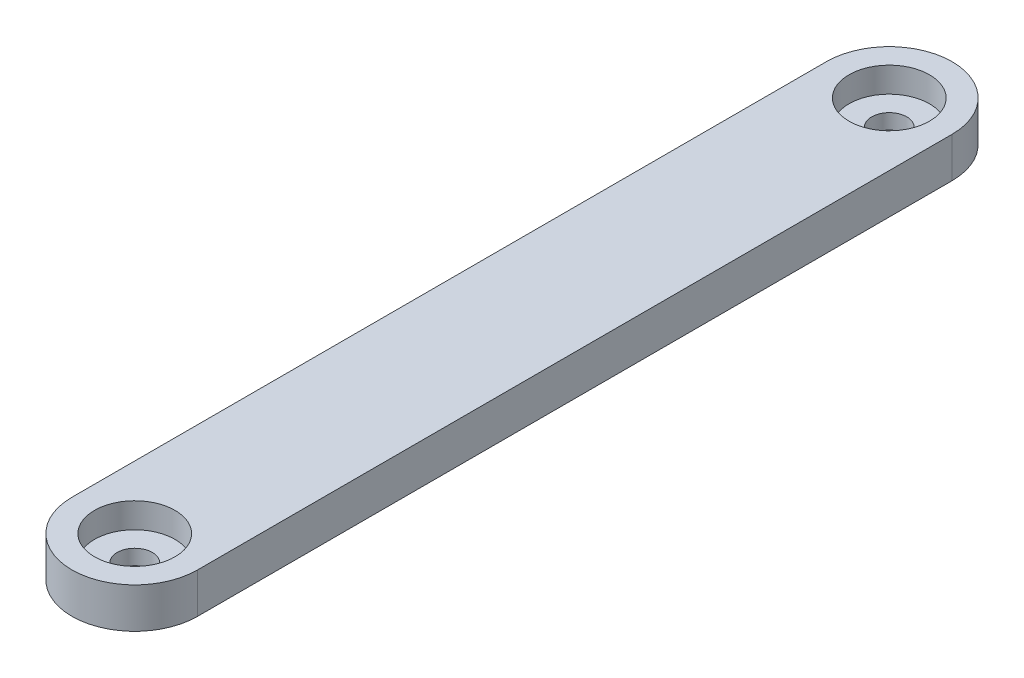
from build123d import *

# Parameters (mm, degrees)
BOSS_EXTRUDE1_DEPTH = 8
SKETCH2_R           = 8
CUT_EXTRUDE1_DEPTH  = 5
SKETCH3_R           = 3.5
CUT_EXTRUDE2_DEPTH  = 164.176285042
SKETCH4_R           = 8
CUT_EXTRUDE3_DEPTH  = 5
SKETCH5_R           = 3.5
CUT_EXTRUDE4_DEPTH  = 164.176285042


with BuildPart() as part:
    # Sketch1 → Boss-Extrude1 (new body)
    with BuildSketch(Plane(origin=(0, 0, 0), x_dir=(1, 0, 0), z_dir=(0, 1, 0))):
        with BuildLine():
            Line((-12.5, 0), (-12.5, -150))
            ThreePointArc((-12.5, -150), (0, -162.5), (12.5, -150))
            Line((12.5, -150), (12.5, 0))
            ThreePointArc((12.5, 0), (0, 12.5), (-12.5, 0))
        make_face()
    extrude(amount=BOSS_EXTRUDE1_DEPTH)

    # Sketch2 → Cut-Extrude1 (cut)
    with BuildSketch(Plane(origin=(0, 8, 0), x_dir=(1, 0, 0), z_dir=(0, 1, 0))):
        with Locations(Location((0, 0, 0), (0, 0, 270))):
            Circle(SKETCH2_R)
    extrude(amount=-CUT_EXTRUDE1_DEPTH, mode=Mode.SUBTRACT)

    # Sketch3 → Cut-Extrude2 (cut, through all)
    with BuildSketch(Plane(origin=(0, 8, 0), x_dir=(1, 0, 0), z_dir=(0, 1, 0))):
        with Locations(Location((0, 0, 0), (0, 0, 270))):
            Circle(SKETCH3_R)
    extrude(amount=-CUT_EXTRUDE2_DEPTH, mode=Mode.SUBTRACT)

    # Sketch4 → Cut-Extrude3 (cut)
    with BuildSketch(Plane(origin=(0, 8, 0), x_dir=(1, 0, 0), z_dir=(0, 1, 0))):
        with Locations(Location((0, -150, 0), (0, 0, 270))):
            Circle(SKETCH4_R)
    extrude(amount=-CUT_EXTRUDE3_DEPTH, mode=Mode.SUBTRACT)

    # Sketch5 → Cut-Extrude4 (cut, through all)
    with BuildSketch(Plane(origin=(0, 8, 0), x_dir=(1, 0, 0), z_dir=(0, 1, 0))):
        with Locations(Location((0, -150, 0), (0, 0, 270))):
            Circle(SKETCH5_R)
    extrude(amount=-CUT_EXTRUDE4_DEPTH, mode=Mode.SUBTRACT)


solid = part.part
